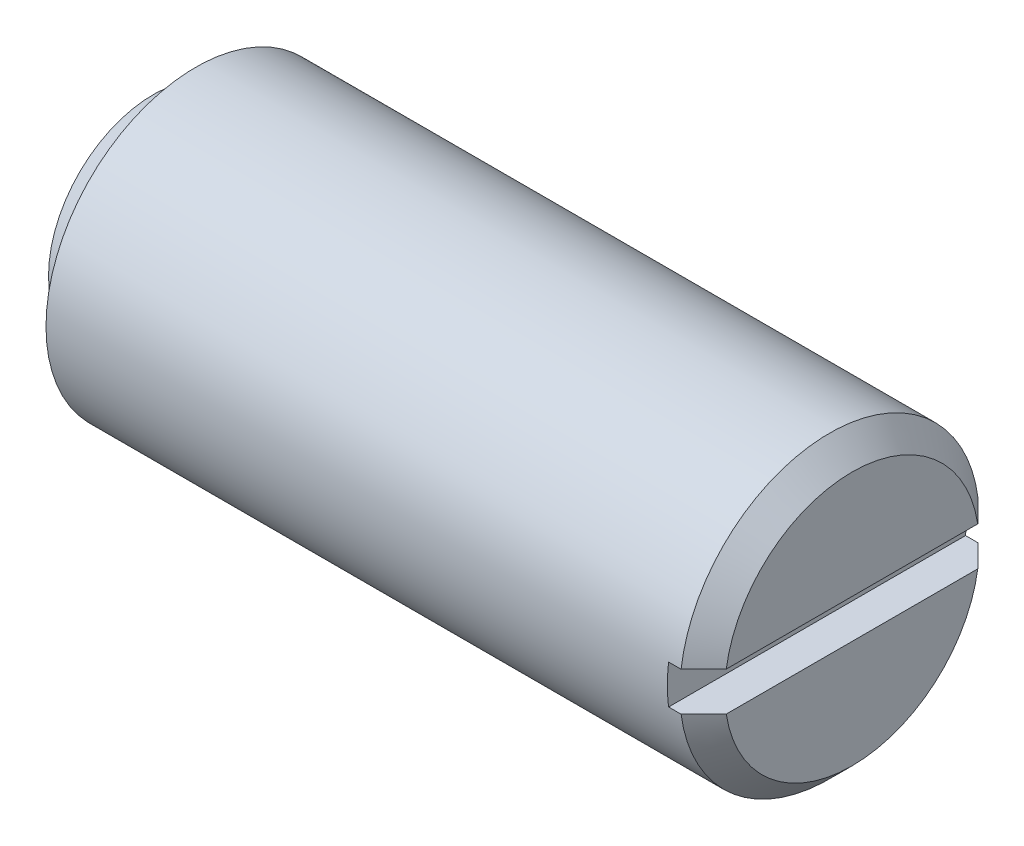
ISO-10303-21;
HEADER;
FILE_DESCRIPTION(('STEP AP214'),'2;1');
FILE_NAME('part.step','',(''),(''),'','','');
FILE_SCHEMA(('AUTOMOTIVE_DESIGN { 1 0 10303 214 1 1 1 1 }'));
ENDSEC;
DATA;
#1=APPLICATION_CONTEXT('core data for automotive mechanical design processes');
#2=APPLICATION_PROTOCOL_DEFINITION('international standard','automotive_design',2000,#1);
#3=PRODUCT_CONTEXT('',#1,'mechanical');
#4=PRODUCT('Part','Part','',(#3));
#5=PRODUCT_RELATED_PRODUCT_CATEGORY('part','',(#4));
#6=PRODUCT_DEFINITION_FORMATION('','',#4);
#7=PRODUCT_DEFINITION_CONTEXT('part definition',#1,'design');
#8=PRODUCT_DEFINITION('design','',#6,#7);
#9=PRODUCT_DEFINITION_SHAPE('','',#8);
#10=(LENGTH_UNIT() NAMED_UNIT(*) SI_UNIT(.MILLI.,.METRE.));
#11=(NAMED_UNIT(*) PLANE_ANGLE_UNIT() SI_UNIT($,.RADIAN.));
#12=(NAMED_UNIT(*) SI_UNIT($,.STERADIAN.) SOLID_ANGLE_UNIT());
#13=UNCERTAINTY_MEASURE_WITH_UNIT(LENGTH_MEASURE(1.E-05),#10,'distance_accuracy_value','');
#14=(GEOMETRIC_REPRESENTATION_CONTEXT(3) GLOBAL_UNCERTAINTY_ASSIGNED_CONTEXT((#13)) GLOBAL_UNIT_ASSIGNED_CONTEXT((#10,
#11,#12)) REPRESENTATION_CONTEXT('',''));
#15=CARTESIAN_POINT('',(0.,0.,0.));
#16=DIRECTION('',(0.,0.,1.));
#17=DIRECTION('',(1.,0.,0.));
#18=AXIS2_PLACEMENT_3D('',#15,#16,#17);
#19=CARTESIAN_POINT('',(14.,0.,0.));
#20=DIRECTION('',(-1.,0.,0.));
#21=DIRECTION('',(0.,0.,1.));
#22=AXIS2_PLACEMENT_3D('',#19,#20,#21);
#23=CONICAL_SURFACE('',#22,2.55,0.785398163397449);
#24=CARTESIAN_POINT('',(13.55,0.,0.));
#25=DIRECTION('',(-1.,0.,0.));
#26=DIRECTION('',(0.,0.,1.));
#27=AXIS2_PLACEMENT_3D('',#24,#25,#26);
#28=CIRCLE('',#27,3.);
#29=CARTESIAN_POINT('',(13.55,-0.389999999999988,-2.97454198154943));
#30=VERTEX_POINT('',#29);
#31=CARTESIAN_POINT('',(13.55,-0.389999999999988,2.97454198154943));
#32=VERTEX_POINT('',#31);
#33=EDGE_CURVE('E126',#30,#32,#28,.T.);
#34=ORIENTED_EDGE('',*,*,#33,.F.);
#35=CARTESIAN_POINT('',(11.5945037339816,-0.389999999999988,-4.94012583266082));
#36=CARTESIAN_POINT('',(11.7815810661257,-0.389999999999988,-4.75245948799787));
#37=CARTESIAN_POINT('',(11.9686317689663,-0.389999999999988,-4.56476654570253));
#38=CARTESIAN_POINT('',(12.3426226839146,-0.389999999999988,-4.18929812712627));
#39=CARTESIAN_POINT('',(12.5295629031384,-0.389999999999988,-4.00152265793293));
#40=CARTESIAN_POINT('',(12.9032653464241,-0.389999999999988,-3.6258702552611));
#41=CARTESIAN_POINT('',(13.0900275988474,-0.389999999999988,-3.4379933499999));
#42=CARTESIAN_POINT('',(13.4633421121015,-0.389999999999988,-3.06200420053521));
#43=CARTESIAN_POINT('',(13.649894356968,-0.389999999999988,-2.87389194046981));
#44=CARTESIAN_POINT('',(13.9294630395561,-0.389999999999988,-2.59138819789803));
#45=CARTESIAN_POINT('',(14.0226288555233,-0.389999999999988,-2.49714456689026));
#46=CARTESIAN_POINT('',(14.2088169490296,-0.389999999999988,-2.30852083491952));
#47=CARTESIAN_POINT('',(14.301839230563,-0.389999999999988,-2.21414073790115));
#48=CARTESIAN_POINT('',(14.4876598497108,-0.389999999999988,-2.02520097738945));
#49=CARTESIAN_POINT('',(14.5804582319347,-0.389999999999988,-1.93064135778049));
#50=CARTESIAN_POINT('',(14.7657568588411,-0.389999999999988,-1.74121119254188));
#51=CARTESIAN_POINT('',(14.8582570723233,-0.389999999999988,-1.64634061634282));
#52=CARTESIAN_POINT('',(14.9966606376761,-0.389999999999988,-1.50362740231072));
#53=CARTESIAN_POINT('',(15.0427549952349,-0.389999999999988,-1.45597006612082));
#54=CARTESIAN_POINT('',(15.1347708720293,-0.389999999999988,-1.36049137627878));
#55=CARTESIAN_POINT('',(15.1806923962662,-0.389999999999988,-1.31267002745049));
#56=CARTESIAN_POINT('',(15.2722866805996,-0.389999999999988,-1.21681999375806));
#57=CARTESIAN_POINT('',(15.3179595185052,-0.389999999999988,-1.1687913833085));
#58=CARTESIAN_POINT('',(15.4089802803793,-0.389999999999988,-1.07241693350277));
#59=CARTESIAN_POINT('',(15.4543281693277,-0.389999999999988,-1.02407106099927));
#60=CARTESIAN_POINT('',(15.5445875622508,-0.389999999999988,-0.926865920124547));
#61=CARTESIAN_POINT('',(15.5894984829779,-0.389999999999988,-0.878006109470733));
#62=CARTESIAN_POINT('',(15.6785431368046,-0.389999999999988,-0.779604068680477));
#63=CARTESIAN_POINT('',(15.7226770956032,-0.389999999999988,-0.730062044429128));
#64=CARTESIAN_POINT('',(15.7879142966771,-0.389999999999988,-0.654849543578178));
#65=CARTESIAN_POINT('',(15.809514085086,-0.389999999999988,-0.629610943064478));
#66=CARTESIAN_POINT('',(15.8522469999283,-0.389999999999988,-0.578747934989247));
#67=CARTESIAN_POINT('',(15.8733801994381,-0.389999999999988,-0.553123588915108));
#68=CARTESIAN_POINT('',(15.9150298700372,-0.389999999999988,-0.501328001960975));
#69=CARTESIAN_POINT('',(15.935545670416,-0.389999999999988,-0.475156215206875));
#70=CARTESIAN_POINT('',(15.9755960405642,-0.389999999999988,-0.422052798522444));
#71=CARTESIAN_POINT('',(15.9951300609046,-0.389999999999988,-0.395120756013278));
#72=CARTESIAN_POINT('',(16.0139908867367,-0.389999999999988,-0.36770337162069));
#73=B_SPLINE_CURVE_WITH_KNOTS('',3,(#35,#36,#37,#38,#39,#40,#41,#42,#43,#44,#45,#46,#47,#48,#49,
#50,#51,#52,#53,#54,#55,#56,#57,#58,#59,#60,#61,#62,#63,#64,#65,#66,#67,#68,#69,#70,#71,#72),
.UNSPECIFIED.,.F.,.F.,(4,2,2,2,2,2,2,2,2,2,2,2,2,2,2,2,2,2,4),(0.,0.794952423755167,
1.58984636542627,2.38457947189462,3.17936938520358,3.5769313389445,3.97448202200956,
4.37194558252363,4.76944946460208,4.9683541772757,5.16725308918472,5.36608571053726,
5.56493944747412,5.7640297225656,5.96306117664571,6.06271553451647,6.16235417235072,
6.26209740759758,6.36189585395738),.UNSPECIFIED.);
#74=CARTESIAN_POINT('',(14.,-0.389999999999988,-2.52));
#75=VERTEX_POINT('',#74);
#76=EDGE_CURVE('E39',#30,#75,#73,.T.);
#77=ORIENTED_EDGE('',*,*,#76,.T.);
#78=CARTESIAN_POINT('',(14.,0.,0.));
#79=DIRECTION('',(-1.,0.,0.));
#80=DIRECTION('',(0.,0.,1.));
#81=AXIS2_PLACEMENT_3D('',#78,#79,#80);
#82=CIRCLE('',#81,2.55);
#83=CARTESIAN_POINT('',(14.,-0.389999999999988,2.52));
#84=VERTEX_POINT('',#83);
#85=EDGE_CURVE('E122',#75,#84,#82,.T.);
#86=ORIENTED_EDGE('',*,*,#85,.T.);
#87=CARTESIAN_POINT('',(16.0139908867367,-0.389999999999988,0.36770337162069));
#88=CARTESIAN_POINT('',(15.9990769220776,-0.389999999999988,0.389410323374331));
#89=CARTESIAN_POINT('',(15.9837251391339,-0.389999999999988,0.410805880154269));
#90=CARTESIAN_POINT('',(15.952352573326,-0.389999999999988,0.453089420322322));
#91=CARTESIAN_POINT('',(15.9363320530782,-0.389999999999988,0.473977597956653));
#92=CARTESIAN_POINT('',(15.9038327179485,-0.389999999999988,0.515357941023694));
#93=CARTESIAN_POINT('',(15.8873543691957,-0.389999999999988,0.535850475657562));
#94=CARTESIAN_POINT('',(15.8540363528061,-0.389999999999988,0.576542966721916));
#95=CARTESIAN_POINT('',(15.8371966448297,-0.389999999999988,0.596742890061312));
#96=CARTESIAN_POINT('',(15.7863105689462,-0.389999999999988,0.656951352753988));
#97=CARTESIAN_POINT('',(15.751858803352,-0.389999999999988,0.696616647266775));
#98=CARTESIAN_POINT('',(15.6822720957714,-0.389999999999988,0.775361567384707));
#99=CARTESIAN_POINT('',(15.6471369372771,-0.389999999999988,0.814441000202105));
#100=CARTESIAN_POINT('',(15.5403185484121,-0.389999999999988,0.931903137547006));
#101=CARTESIAN_POINT('',(15.4679551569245,-0.389999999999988,1.00966602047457));
#102=CARTESIAN_POINT('',(15.322335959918,-0.389999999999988,1.16435217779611));
#103=CARTESIAN_POINT('',(15.2490801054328,-0.389999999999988,1.24127540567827));
#104=CARTESIAN_POINT('',(15.1020438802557,-0.389999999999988,1.39461521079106));
#105=CARTESIAN_POINT('',(15.0282635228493,-0.389999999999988,1.47103180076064));
#106=CARTESIAN_POINT('',(14.8803747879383,-0.389999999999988,1.62354239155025));
#107=CARTESIAN_POINT('',(14.8062664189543,-0.389999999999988,1.69963640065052));
#108=CARTESIAN_POINT('',(14.5833479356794,-0.389999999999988,1.92787621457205));
#109=CARTESIAN_POINT('',(14.4342115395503,-0.389999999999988,2.07970319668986));
#110=CARTESIAN_POINT('',(14.1355086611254,-0.389999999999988,2.38292327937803));
#111=CARTESIAN_POINT('',(13.9859421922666,-0.389999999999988,2.53431639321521));
#112=CARTESIAN_POINT('',(13.6496444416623,-0.389999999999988,2.87414411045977));
#113=CARTESIAN_POINT('',(13.4628420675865,-0.389999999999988,3.06250835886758));
#114=CARTESIAN_POINT('',(13.0890111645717,-0.389999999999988,3.43901654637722));
#115=CARTESIAN_POINT('',(12.9019826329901,-0.389999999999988,3.62716048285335));
#116=CARTESIAN_POINT('',(12.5282634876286,-0.389999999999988,4.00282802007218));
#117=CARTESIAN_POINT('',(12.3415732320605,-0.389999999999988,4.19035197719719));
#118=CARTESIAN_POINT('',(11.9680987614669,-0.389999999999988,4.56530142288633));
#119=CARTESIAN_POINT('',(11.7813145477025,-0.389999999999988,4.75272691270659));
#120=CARTESIAN_POINT('',(11.5945037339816,-0.389999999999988,4.94012583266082));
#121=B_SPLINE_CURVE_WITH_KNOTS('',3,(#87,#88,#89,#90,#91,#92,#93,#94,#95,#96,#97,#98,#99,#100,
#101,#102,#103,#104,#105,#106,#107,#108,#109,#110,#111,#112,#113,#114,#115,#116,#117,#118,#119,
#120),.UNSPECIFIED.,.F.,.F.,(4,2,2,2,2,2,2,2,2,2,2,2,2,2,2,2,4),(0.,0.0789919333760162,
0.157953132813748,0.236836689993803,0.315729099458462,0.473329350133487,0.630980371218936,
0.949633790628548,1.26830477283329,1.58696771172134,1.90562242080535,2.5440853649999,
3.18252857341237,3.97838361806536,4.77424805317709,5.56807819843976,6.36189795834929),.UNSPECIFIED.);
#122=EDGE_CURVE('E87',#84,#32,#121,.T.);
#123=ORIENTED_EDGE('',*,*,#122,.T.);
#124=EDGE_LOOP('',(#34,#77,#86,#123));
#125=FACE_BOUND('',#124,.T.);
#126=ADVANCED_FACE('F16',(#125),#23,.T.);
#127=CARTESIAN_POINT('',(14.,0.,0.));
#128=DIRECTION('',(-1.,0.,0.));
#129=DIRECTION('',(0.,0.,1.));
#130=AXIS2_PLACEMENT_3D('',#127,#128,#129);
#131=PLANE('',#130);
#132=ORIENTED_EDGE('',*,*,#85,.F.);
#133=DIRECTION('',(0.,0.,1.));
#134=VECTOR('',#133,1.);
#135=CARTESIAN_POINT('',(14.,-0.389999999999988,-4.5));
#136=LINE('',#135,#134);
#137=EDGE_CURVE('E175',#75,#84,#136,.T.);
#138=ORIENTED_EDGE('',*,*,#137,.T.);
#139=EDGE_LOOP('',(#132,#138));
#140=FACE_BOUND('',#139,.T.);
#141=ADVANCED_FACE('F157',(#140),#131,.F.);
#142=CARTESIAN_POINT('',(0.,0.,0.));
#143=DIRECTION('',(-1.,0.,0.));
#144=DIRECTION('',(0.,0.,1.));
#145=AXIS2_PLACEMENT_3D('',#142,#143,#144);
#146=PLANE('',#145);
#147=CARTESIAN_POINT('',(0.,0.,0.));
#148=DIRECTION('',(-1.,0.,0.));
#149=DIRECTION('',(0.,0.,1.));
#150=AXIS2_PLACEMENT_3D('',#147,#148,#149);
#151=CIRCLE('',#150,1.58113883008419);
#152=CARTESIAN_POINT('',(0.,0.,1.58113883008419));
#153=VERTEX_POINT('',#152);
#154=EDGE_CURVE('E136',#153,#153,#151,.T.);
#155=ORIENTED_EDGE('',*,*,#154,.F.);
#156=EDGE_LOOP('',(#155));
#157=FACE_BOUND('',#156,.T.);
#158=CARTESIAN_POINT('',(0.,0.,0.));
#159=DIRECTION('',(-1.,0.,0.));
#160=DIRECTION('',(0.,0.,1.));
#161=AXIS2_PLACEMENT_3D('',#158,#159,#160);
#162=CIRCLE('',#161,2.1);
#163=CARTESIAN_POINT('',(0.,0.,2.1));
#164=VERTEX_POINT('',#163);
#165=EDGE_CURVE('E134',#164,#164,#162,.T.);
#166=ORIENTED_EDGE('',*,*,#165,.T.);
#167=EDGE_LOOP('',(#166));
#168=FACE_BOUND('',#167,.T.);
#169=ADVANCED_FACE('F18',(#157,#168),#146,.T.);
#170=CARTESIAN_POINT('',(0.333333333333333,0.,0.));
#171=DIRECTION('',(1.,0.,0.));
#172=DIRECTION('',(0.,0.,-1.));
#173=AXIS2_PLACEMENT_3D('',#170,#171,#172);
#174=CONICAL_SURFACE('',#173,2.25,0.422853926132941);
#175=ORIENTED_EDGE('',*,*,#165,.F.);
#176=EDGE_LOOP('',(#175));
#177=FACE_BOUND('',#176,.T.);
#178=CARTESIAN_POINT('',(0.333333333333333,0.,0.));
#179=DIRECTION('',(-1.,0.,0.));
#180=DIRECTION('',(0.,0.,1.));
#181=AXIS2_PLACEMENT_3D('',#178,#179,#180);
#182=CIRCLE('',#181,2.25);
#183=CARTESIAN_POINT('',(0.333333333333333,0.,2.25));
#184=VERTEX_POINT('',#183);
#185=EDGE_CURVE('E131',#184,#184,#182,.T.);
#186=ORIENTED_EDGE('',*,*,#185,.T.);
#187=EDGE_LOOP('',(#186));
#188=FACE_BOUND('',#187,.T.);
#189=ADVANCED_FACE('F184',(#177,#188),#174,.T.);
#190=CARTESIAN_POINT('',(0.85,0.,0.));
#191=DIRECTION('',(1.,0.,0.));
#192=DIRECTION('',(0.,0.,-1.));
#193=AXIS2_PLACEMENT_3D('',#190,#191,#192);
#194=CONICAL_SURFACE('',#193,3.,0.967566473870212);
#195=ORIENTED_EDGE('',*,*,#185,.F.);
#196=EDGE_LOOP('',(#195));
#197=FACE_BOUND('',#196,.T.);
#198=CARTESIAN_POINT('',(0.85,0.,0.));
#199=DIRECTION('',(-1.,0.,0.));
#200=DIRECTION('',(0.,0.,1.));
#201=AXIS2_PLACEMENT_3D('',#198,#199,#200);
#202=CIRCLE('',#201,3.);
#203=CARTESIAN_POINT('',(0.85,0.,3.));
#204=VERTEX_POINT('',#203);
#205=EDGE_CURVE('E128',#204,#204,#202,.T.);
#206=ORIENTED_EDGE('',*,*,#205,.T.);
#207=EDGE_LOOP('',(#206));
#208=FACE_BOUND('',#207,.T.);
#209=ADVANCED_FACE('F172',(#197,#208),#194,.T.);
#210=CARTESIAN_POINT('',(0.,0.,0.));
#211=DIRECTION('',(-1.,0.,0.));
#212=DIRECTION('',(0.,0.,1.));
#213=AXIS2_PLACEMENT_3D('',#210,#211,#212);
#214=CYLINDRICAL_SURFACE('',#213,3.);
#215=ORIENTED_EDGE('',*,*,#205,.F.);
#216=EDGE_LOOP('',(#215));
#217=FACE_BOUND('',#216,.T.);
#218=CARTESIAN_POINT('',(13.3,0.,0.));
#219=DIRECTION('',(-1.,0.,0.));
#220=DIRECTION('',(0.,0.,1.));
#221=AXIS2_PLACEMENT_3D('',#218,#219,#220);
#222=CIRCLE('',#221,3.);
#223=CARTESIAN_POINT('',(13.3,0.390000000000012,-2.97454198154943));
#224=VERTEX_POINT('',#223);
#225=CARTESIAN_POINT('',(13.3,-0.389999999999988,-2.97454198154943));
#226=VERTEX_POINT('',#225);
#227=EDGE_CURVE('E11',#224,#226,#222,.T.);
#228=ORIENTED_EDGE('',*,*,#227,.T.);
#229=DIRECTION('',(-1.,0.,0.));
#230=VECTOR('',#229,1.);
#231=CARTESIAN_POINT('',(0.,-0.389999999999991,-2.97454198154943));
#232=LINE('',#231,#230);
#233=EDGE_CURVE('E120',#226,#30,#232,.F.);
#234=ORIENTED_EDGE('',*,*,#233,.T.);
#235=ORIENTED_EDGE('',*,*,#33,.T.);
#236=DIRECTION('',(-1.,0.,0.));
#237=VECTOR('',#236,1.);
#238=CARTESIAN_POINT('',(0.,-0.389999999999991,2.97454198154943));
#239=LINE('',#238,#237);
#240=CARTESIAN_POINT('',(13.3,-0.389999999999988,2.97454198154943));
#241=VERTEX_POINT('',#240);
#242=EDGE_CURVE('E90',#32,#241,#239,.T.);
#243=ORIENTED_EDGE('',*,*,#242,.T.);
#244=CARTESIAN_POINT('',(13.3,0.390000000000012,2.97454198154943));
#245=VERTEX_POINT('',#244);
#246=EDGE_CURVE('E20',#241,#245,#222,.T.);
#247=ORIENTED_EDGE('',*,*,#246,.T.);
#248=DIRECTION('',(-1.,0.,0.));
#249=VECTOR('',#248,1.);
#250=CARTESIAN_POINT('',(0.,0.390000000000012,2.97454198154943));
#251=LINE('',#250,#249);
#252=CARTESIAN_POINT('',(13.55,0.390000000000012,2.97454198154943));
#253=VERTEX_POINT('',#252);
#254=EDGE_CURVE('E80',#245,#253,#251,.F.);
#255=ORIENTED_EDGE('',*,*,#254,.T.);
#256=CARTESIAN_POINT('',(13.55,0.390000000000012,-2.97454198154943));
#257=VERTEX_POINT('',#256);
#258=EDGE_CURVE('E86',#253,#257,#28,.T.);
#259=ORIENTED_EDGE('',*,*,#258,.T.);
#260=DIRECTION('',(-1.,0.,0.));
#261=VECTOR('',#260,1.);
#262=CARTESIAN_POINT('',(0.,0.390000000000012,-2.97454198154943));
#263=LINE('',#262,#261);
#264=EDGE_CURVE('E78',#257,#224,#263,.T.);
#265=ORIENTED_EDGE('',*,*,#264,.T.);
#266=EDGE_LOOP('',(#228,#234,#235,#243,#247,#255,#259,#265));
#267=FACE_BOUND('',#266,.T.);
#268=ADVANCED_FACE('F84',(#217,#267),#214,.T.);
#269=CARTESIAN_POINT('',(14.,0.390000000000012,2.52));
#270=VERTEX_POINT('',#269);
#271=CARTESIAN_POINT('',(14.,0.390000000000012,-2.52));
#272=VERTEX_POINT('',#271);
#273=EDGE_CURVE('E123',#270,#272,#82,.T.);
#274=ORIENTED_EDGE('',*,*,#273,.T.);
#275=CARTESIAN_POINT('',(16.0139908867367,0.390000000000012,-0.36770337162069));
#276=CARTESIAN_POINT('',(15.9990769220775,0.390000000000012,-0.389410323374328));
#277=CARTESIAN_POINT('',(15.9837251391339,0.390000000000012,-0.410805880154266));
#278=CARTESIAN_POINT('',(15.952352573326,0.390000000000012,-0.45308942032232));
#279=CARTESIAN_POINT('',(15.9363320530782,0.390000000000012,-0.473977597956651));
#280=CARTESIAN_POINT('',(15.9038327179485,0.390000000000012,-0.515357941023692));
#281=CARTESIAN_POINT('',(15.8873543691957,0.390000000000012,-0.53585047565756));
#282=CARTESIAN_POINT('',(15.8540363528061,0.390000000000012,-0.576542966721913));
#283=CARTESIAN_POINT('',(15.8371966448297,0.390000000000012,-0.59674289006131));
#284=CARTESIAN_POINT('',(15.7863105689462,0.390000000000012,-0.656951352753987));
#285=CARTESIAN_POINT('',(15.751858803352,0.390000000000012,-0.696616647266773));
#286=CARTESIAN_POINT('',(15.6822720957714,0.390000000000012,-0.775361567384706));
#287=CARTESIAN_POINT('',(15.6471369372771,0.390000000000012,-0.814441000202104));
#288=CARTESIAN_POINT('',(15.5403185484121,0.390000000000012,-0.931903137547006));
#289=CARTESIAN_POINT('',(15.4679551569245,0.390000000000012,-1.00966602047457));
#290=CARTESIAN_POINT('',(15.322335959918,0.390000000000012,-1.16435217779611));
#291=CARTESIAN_POINT('',(15.2490801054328,0.390000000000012,-1.24127540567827));
#292=CARTESIAN_POINT('',(15.1020438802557,0.390000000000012,-1.39461521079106));
#293=CARTESIAN_POINT('',(15.0282635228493,0.390000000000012,-1.47103180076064));
#294=CARTESIAN_POINT('',(14.8803747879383,0.390000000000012,-1.62354239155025));
#295=CARTESIAN_POINT('',(14.8062664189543,0.390000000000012,-1.69963640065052));
#296=CARTESIAN_POINT('',(14.5833479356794,0.390000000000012,-1.92787621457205));
#297=CARTESIAN_POINT('',(14.4342115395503,0.390000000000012,-2.07970319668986));
#298=CARTESIAN_POINT('',(14.1355086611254,0.390000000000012,-2.38292327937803));
#299=CARTESIAN_POINT('',(13.9859421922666,0.390000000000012,-2.53431639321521));
#300=CARTESIAN_POINT('',(13.6496444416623,0.390000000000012,-2.87414411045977));
#301=CARTESIAN_POINT('',(13.4628420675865,0.390000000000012,-3.06250835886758));
#302=CARTESIAN_POINT('',(13.0890111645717,0.390000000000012,-3.43901654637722));
#303=CARTESIAN_POINT('',(12.9019826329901,0.390000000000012,-3.62716048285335));
#304=CARTESIAN_POINT('',(12.5282634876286,0.390000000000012,-4.00282802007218));
#305=CARTESIAN_POINT('',(12.3415732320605,0.390000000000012,-4.19035197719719));
#306=CARTESIAN_POINT('',(11.9680987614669,0.390000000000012,-4.56530142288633));
#307=CARTESIAN_POINT('',(11.7813145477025,0.390000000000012,-4.75272691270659));
#308=CARTESIAN_POINT('',(11.5945037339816,0.390000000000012,-4.94012583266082));
#309=B_SPLINE_CURVE_WITH_KNOTS('',3,(#275,#276,#277,#278,#279,#280,#281,#282,#283,#284,#285,
#286,#287,#288,#289,#290,#291,#292,#293,#294,#295,#296,#297,#298,#299,#300,#301,#302,#303,#304,
#305,#306,#307,#308),.UNSPECIFIED.,.F.,.F.,(4,2,2,2,2,2,2,2,2,2,2,2,2,2,2,2,4),(0.,
0.0789919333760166,0.157953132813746,0.236836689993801,0.31572909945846,0.473329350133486,
0.630980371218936,0.949633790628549,1.26830477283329,1.58696771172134,1.90562242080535,
2.5440853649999,3.18252857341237,3.97838361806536,4.77424805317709,5.56807819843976,
6.36189795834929),.UNSPECIFIED.);
#310=EDGE_CURVE('E31',#272,#257,#309,.T.);
#311=ORIENTED_EDGE('',*,*,#310,.T.);
#312=ORIENTED_EDGE('',*,*,#258,.F.);
#313=CARTESIAN_POINT('',(11.5945037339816,0.390000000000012,4.94012583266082));
#314=CARTESIAN_POINT('',(11.7815810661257,0.390000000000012,4.75245948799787));
#315=CARTESIAN_POINT('',(11.9686317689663,0.390000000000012,4.56476654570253));
#316=CARTESIAN_POINT('',(12.3426226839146,0.390000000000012,4.18929812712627));
#317=CARTESIAN_POINT('',(12.5295629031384,0.390000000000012,4.00152265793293));
#318=CARTESIAN_POINT('',(12.9032653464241,0.390000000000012,3.6258702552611));
#319=CARTESIAN_POINT('',(13.0900275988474,0.390000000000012,3.4379933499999));
#320=CARTESIAN_POINT('',(13.4633421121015,0.390000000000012,3.06200420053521));
#321=CARTESIAN_POINT('',(13.649894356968,0.390000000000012,2.87389194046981));
#322=CARTESIAN_POINT('',(13.9294630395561,0.390000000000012,2.59138819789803));
#323=CARTESIAN_POINT('',(14.0226288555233,0.390000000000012,2.49714456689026));
#324=CARTESIAN_POINT('',(14.2088169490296,0.390000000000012,2.30852083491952));
#325=CARTESIAN_POINT('',(14.301839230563,0.390000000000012,2.21414073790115));
#326=CARTESIAN_POINT('',(14.4876598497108,0.390000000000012,2.02520097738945));
#327=CARTESIAN_POINT('',(14.5804582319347,0.390000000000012,1.9306413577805));
#328=CARTESIAN_POINT('',(14.7657568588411,0.390000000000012,1.74121119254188));
#329=CARTESIAN_POINT('',(14.8582570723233,0.390000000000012,1.64634061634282));
#330=CARTESIAN_POINT('',(14.9966606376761,0.390000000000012,1.50362740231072));
#331=CARTESIAN_POINT('',(15.0427549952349,0.390000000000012,1.45597006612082));
#332=CARTESIAN_POINT('',(15.1347708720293,0.390000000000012,1.36049137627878));
#333=CARTESIAN_POINT('',(15.1806923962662,0.390000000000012,1.31267002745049));
#334=CARTESIAN_POINT('',(15.2722866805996,0.390000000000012,1.21681999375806));
#335=CARTESIAN_POINT('',(15.3179595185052,0.390000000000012,1.16879138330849));
#336=CARTESIAN_POINT('',(15.4089802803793,0.390000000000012,1.07241693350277));
#337=CARTESIAN_POINT('',(15.4543281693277,0.390000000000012,1.02407106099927));
#338=CARTESIAN_POINT('',(15.5445875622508,0.390000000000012,0.926865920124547));
#339=CARTESIAN_POINT('',(15.5894984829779,0.390000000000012,0.878006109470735));
#340=CARTESIAN_POINT('',(15.6785431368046,0.390000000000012,0.779604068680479));
#341=CARTESIAN_POINT('',(15.7226770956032,0.390000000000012,0.730062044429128));
#342=CARTESIAN_POINT('',(15.7879142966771,0.390000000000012,0.654849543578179));
#343=CARTESIAN_POINT('',(15.809514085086,0.390000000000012,0.629610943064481));
#344=CARTESIAN_POINT('',(15.8522469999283,0.390000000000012,0.57874793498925));
#345=CARTESIAN_POINT('',(15.8733801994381,0.390000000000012,0.553123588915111));
#346=CARTESIAN_POINT('',(15.9150298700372,0.390000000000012,0.501328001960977));
#347=CARTESIAN_POINT('',(15.935545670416,0.390000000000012,0.475156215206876));
#348=CARTESIAN_POINT('',(15.9755960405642,0.390000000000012,0.422052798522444));
#349=CARTESIAN_POINT('',(15.9951300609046,0.390000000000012,0.395120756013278));
#350=CARTESIAN_POINT('',(16.0139908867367,0.390000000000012,0.36770337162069));
#351=B_SPLINE_CURVE_WITH_KNOTS('',3,(#313,#314,#315,#316,#317,#318,#319,#320,#321,#322,#323,
#324,#325,#326,#327,#328,#329,#330,#331,#332,#333,#334,#335,#336,#337,#338,#339,#340,#341,#342,
#343,#344,#345,#346,#347,#348,#349,#350),.UNSPECIFIED.,.F.,.F.,(4,2,2,2,2,2,2,2,2,2,2,2,2,2,2,2,
2,2,4),(0.,0.794952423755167,1.58984636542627,2.38457947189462,3.17936938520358,3.5769313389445,
3.97448202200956,4.37194558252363,4.76944946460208,4.9683541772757,5.16725308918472,
5.36608571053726,5.56493944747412,5.7640297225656,5.96306117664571,6.06271553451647,
6.16235417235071,6.26209740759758,6.36189585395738),.UNSPECIFIED.);
#352=EDGE_CURVE('E142',#253,#270,#351,.T.);
#353=ORIENTED_EDGE('',*,*,#352,.T.);
#354=EDGE_LOOP('',(#274,#311,#312,#353));
#355=FACE_BOUND('',#354,.T.);
#356=ADVANCED_FACE('F105',(#355),#23,.T.);
#357=ORIENTED_EDGE('',*,*,#273,.F.);
#358=DIRECTION('',(0.,0.,1.));
#359=VECTOR('',#358,1.);
#360=CARTESIAN_POINT('',(14.,0.390000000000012,-4.5));
#361=LINE('',#360,#359);
#362=EDGE_CURVE('E81',#272,#270,#361,.T.);
#363=ORIENTED_EDGE('',*,*,#362,.F.);
#364=EDGE_LOOP('',(#357,#363));
#365=FACE_BOUND('',#364,.T.);
#366=ADVANCED_FACE('F163',(#365),#131,.F.);
#367=CARTESIAN_POINT('',(0.750000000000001,0.,0.));
#368=DIRECTION('',(0.,0.,1.));
#369=DIRECTION('',(1.,0.,0.));
#370=AXIS2_PLACEMENT_3D('',#367,#368,#369);
#371=SPHERICAL_SURFACE('',#370,1.75);
#372=CARTESIAN_POINT('',(0.750000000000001,0.,0.));
#373=DIRECTION('',(-1.,0.,0.));
#374=DIRECTION('',(0.,0.,1.));
#375=AXIS2_PLACEMENT_3D('',#372,#373,#374);
#376=SPHERICAL_SURFACE('',#375,1.75);
#377=ORIENTED_EDGE('',*,*,#154,.T.);
#378=EDGE_LOOP('',(#377));
#379=FACE_BOUND('',#378,.T.);
#380=ADVANCED_FACE('F114',(#379),#376,.T.);
#381=CARTESIAN_POINT('',(13.3,0.,-4.5));
#382=DIRECTION('',(-1.,0.,0.));
#383=DIRECTION('',(0.,0.,1.));
#384=AXIS2_PLACEMENT_3D('',#381,#382,#383);
#385=PLANE('',#384);
#386=DIRECTION('',(0.,0.,1.));
#387=VECTOR('',#386,1.);
#388=CARTESIAN_POINT('',(13.3,0.390000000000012,-4.5));
#389=LINE('',#388,#387);
#390=EDGE_CURVE('E71',#224,#245,#389,.T.);
#391=ORIENTED_EDGE('',*,*,#390,.T.);
#392=ORIENTED_EDGE('',*,*,#246,.F.);
#393=DIRECTION('',(0.,0.,1.));
#394=VECTOR('',#393,1.);
#395=CARTESIAN_POINT('',(13.3,-0.389999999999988,-4.5));
#396=LINE('',#395,#394);
#397=EDGE_CURVE('E74',#226,#241,#396,.T.);
#398=ORIENTED_EDGE('',*,*,#397,.F.);
#399=ORIENTED_EDGE('',*,*,#227,.F.);
#400=EDGE_LOOP('',(#391,#392,#398,#399));
#401=FACE_BOUND('',#400,.T.);
#402=ADVANCED_FACE('F70',(#401),#385,.F.);
#403=CARTESIAN_POINT('',(13.65,-0.389999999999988,-4.5));
#404=DIRECTION('',(0.,-1.,0.));
#405=DIRECTION('',(0.,0.,-1.));
#406=AXIS2_PLACEMENT_3D('',#403,#404,#405);
#407=PLANE('',#406);
#408=ORIENTED_EDGE('',*,*,#397,.T.);
#409=ORIENTED_EDGE('',*,*,#242,.F.);
#410=ORIENTED_EDGE('',*,*,#122,.F.);
#411=ORIENTED_EDGE('',*,*,#137,.F.);
#412=ORIENTED_EDGE('',*,*,#76,.F.);
#413=ORIENTED_EDGE('',*,*,#233,.F.);
#414=EDGE_LOOP('',(#408,#409,#410,#411,#412,#413));
#415=FACE_BOUND('',#414,.T.);
#416=ADVANCED_FACE('F109',(#415),#407,.F.);
#417=CARTESIAN_POINT('',(13.65,0.390000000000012,-4.5));
#418=DIRECTION('',(0.,1.,0.));
#419=DIRECTION('',(0.,0.,1.));
#420=AXIS2_PLACEMENT_3D('',#417,#418,#419);
#421=PLANE('',#420);
#422=ORIENTED_EDGE('',*,*,#310,.F.);
#423=ORIENTED_EDGE('',*,*,#362,.T.);
#424=ORIENTED_EDGE('',*,*,#352,.F.);
#425=ORIENTED_EDGE('',*,*,#254,.F.);
#426=ORIENTED_EDGE('',*,*,#390,.F.);
#427=ORIENTED_EDGE('',*,*,#264,.F.);
#428=EDGE_LOOP('',(#422,#423,#424,#425,#426,#427));
#429=FACE_BOUND('',#428,.T.);
#430=ADVANCED_FACE('F77',(#429),#421,.F.);
#431=CLOSED_SHELL('',(#126,#141,#169,#189,#209,#268,#356,#366,#380,#402,#416,#430));
#432=MANIFOLD_SOLID_BREP('B1',#431);
#433=ADVANCED_BREP_SHAPE_REPRESENTATION('',(#18,#432),#14);
#434=SHAPE_DEFINITION_REPRESENTATION(#9,#433);
ENDSEC;
END-ISO-10303-21;
